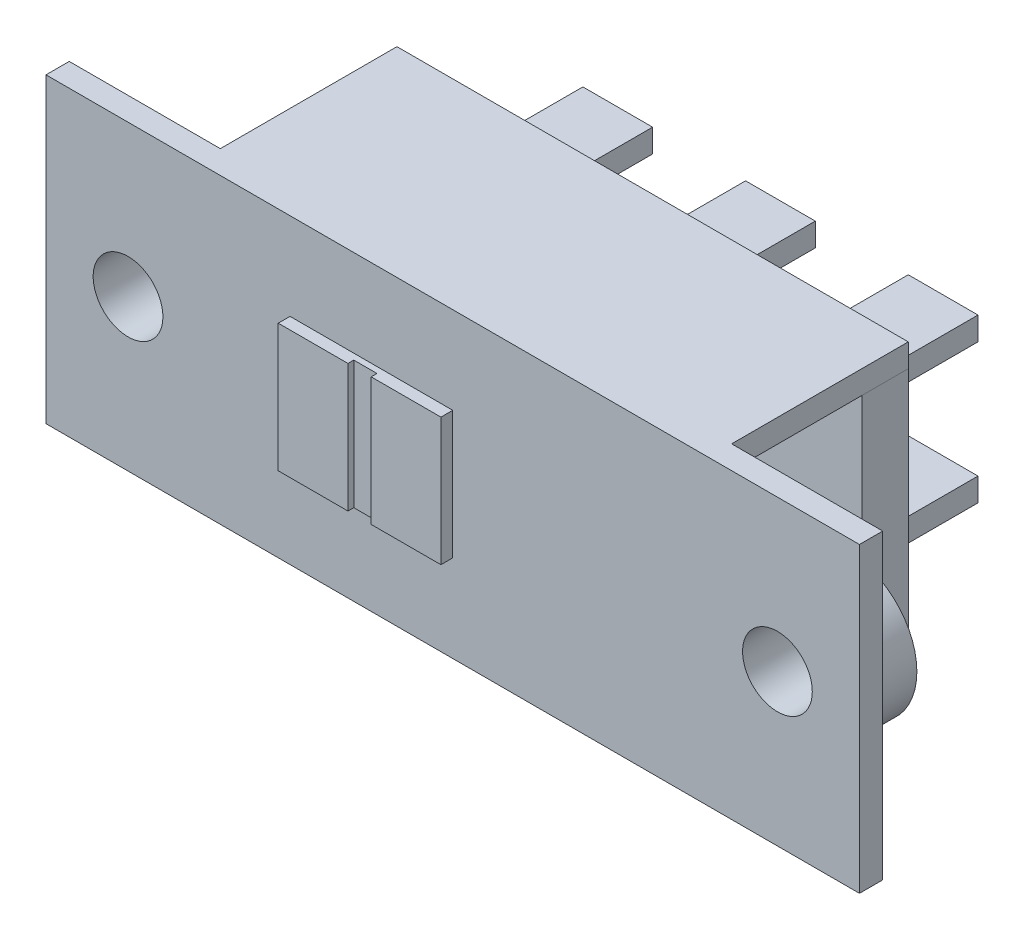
from build123d import *

# Parameters (mm, degrees)
SKETCH_1_W          = 35
SKETCH_1_H          = 13
EXTRUDE_1_DEPTH     = 1
SKETCH_2_R          = 3
EXTRUDE_2_DEPTH     = 2
SKETCH_3_W          = 22
SKETCH_3_H          = 1
EXTRUDE_3_DEPTH     = 7.6
SKETCH_4_R          = 1.5
CUT_EXTRUDE_1_DEPTH = 3
SKETCH_5_W          = 22
SKETCH_5_H          = 11
EXTRUDE_4_DEPTH     = 2
SKETCH_6_W          = 3
SKETCH_6_H          = 1
EXTRUDE_5_DEPTH     = 5.5
EXTRUDE_5_2_DEPTH   = 5.5
EXTRUDE_5_3_DEPTH   = 5.5
EXTRUDE_5_4_DEPTH   = 5.5
EXTRUDE_5_5_DEPTH   = 5.5
EXTRUDE_5_6_DEPTH   = 5.5
SKETCH_7_W          = 7
SKETCH_7_H          = 5.5
EXTRUDE_6_DEPTH     = 0.508
SKETCH1_W           = 1
SKETCH1_H           = 5.5
CUT_EXTRUDE1_DEPTH  = 0.25


with BuildPart() as part:
    # Sketch 1 → Extrude 1 (new body)
    with BuildSketch(Plane.XY):
        Rectangle(SKETCH_1_W, SKETCH_1_H)
    extrude(amount=EXTRUDE_1_DEPTH)

    # Sketch 2 → Extrude 2 (add)
    with BuildSketch(Plane(origin=(0, 0, 0), x_dir=(-1, 0, 0), z_dir=(0, 0, -1))):
        with Locations(Location((13.97, 0, 0), (0, 0, 180))):
            Circle(SKETCH_2_R)
        with Locations(Location((-13.97, 0, 0), (0, 0, 180))):
            Circle(SKETCH_2_R)
    extrude(amount=EXTRUDE_2_DEPTH)

    # Sketch 3 → Extrude 3 (add)
    with BuildSketch(Plane(origin=(0, 0, 0), x_dir=(-1, 0, 0), z_dir=(0, 0, -1))):
        with Locations((0, -6)):
            Rectangle(SKETCH_3_W, SKETCH_3_H)
        with Locations((0, 6)):
            Rectangle(SKETCH_3_W, SKETCH_3_H)
    extrude(amount=EXTRUDE_3_DEPTH)

    # Sketch 4 → Cut-Extrude 1 (cut)
    with BuildSketch(Plane.XY.offset(1)):
        with Locations((-13.97, 0)):
            Circle(SKETCH_4_R)
        with Locations((13.97, 0)):
            Circle(SKETCH_4_R)
    extrude(amount=-CUT_EXTRUDE_1_DEPTH, mode=Mode.SUBTRACT)


with BuildPart() as body_2:
    # Sketch 5 → Extrude 4 (new body)
    with BuildSketch(Plane(origin=(0, 0, -7.6), x_dir=(-1, 0, 0), z_dir=(0, 0, -1))):
        Rectangle(SKETCH_5_W, SKETCH_5_H)
    extrude(amount=-EXTRUDE_4_DEPTH)


with BuildPart() as body_3:
    # Sketch 6 → Extrude 5 (new body)
    with BuildSketch(Plane(origin=(0, 0, -7.6), x_dir=(-1, 0, 0), z_dir=(0, 0, -1))):
        with Locations((0, -3)):
            Rectangle(SKETCH_6_W, SKETCH_6_H)
    extrude(amount=EXTRUDE_5_DEPTH)


with BuildPart() as body_4:
    # Sketch 6 → Extrude 5 2 (new body)
    with BuildSketch(Plane(origin=(0, 0, -7.6), x_dir=(-1, 0, 0), z_dir=(0, 0, -1))):
        with Locations((7, -3)):
            Rectangle(SKETCH_6_W, SKETCH_6_H)
    extrude(amount=EXTRUDE_5_2_DEPTH)


with BuildPart() as body_5:
    # Sketch 6 → Extrude 5 3 (new body)
    with BuildSketch(Plane(origin=(0, 0, -7.6), x_dir=(-1, 0, 0), z_dir=(0, 0, -1))):
        with Locations((-7, -3)):
            Rectangle(SKETCH_6_W, SKETCH_6_H)
    extrude(amount=EXTRUDE_5_3_DEPTH)


with BuildPart() as body_6:
    # Sketch 6 → Extrude 5 4 (new body)
    with BuildSketch(Plane(origin=(0, 0, -7.6), x_dir=(-1, 0, 0), z_dir=(0, 0, -1))):
        with Locations((7, 3)):
            Rectangle(SKETCH_6_W, SKETCH_6_H)
    extrude(amount=EXTRUDE_5_4_DEPTH)


with BuildPart() as body_7:
    # Sketch 6 → Extrude 5 5 (new body)
    with BuildSketch(Plane(origin=(0, 0, -7.6), x_dir=(-1, 0, 0), z_dir=(0, 0, -1))):
        with Locations((0, 3)):
            Rectangle(SKETCH_6_W, SKETCH_6_H)
    extrude(amount=EXTRUDE_5_5_DEPTH)


with BuildPart() as body_8:
    # Sketch 6 → Extrude 5 6 (new body)
    with BuildSketch(Plane(origin=(0, 0, -7.6), x_dir=(-1, 0, 0), z_dir=(0, 0, -1))):
        with Locations((-7, 3)):
            Rectangle(SKETCH_6_W, SKETCH_6_H)
    extrude(amount=EXTRUDE_5_6_DEPTH)


with BuildPart() as body_9:
    # Sketch 7 → Extrude 6 (new body)
    with BuildSketch(Plane.XY.offset(1)):
        with Locations((-3.5, 0)):
            Rectangle(SKETCH_7_W, SKETCH_7_H)
    extrude(amount=EXTRUDE_6_DEPTH)

    # Sketch1 → Cut-Extrude1 (cut)
    with BuildSketch(Plane.XY.offset(1.508)):
        with Locations((-3.5, 0)):
            Rectangle(SKETCH1_W, SKETCH1_H)
    extrude(amount=-CUT_EXTRUDE1_DEPTH, mode=Mode.SUBTRACT)


solid = Compound([part.part, body_2.part, body_3.part, body_4.part, body_5.part, body_6.part, body_7.part, body_8.part, body_9.part])
